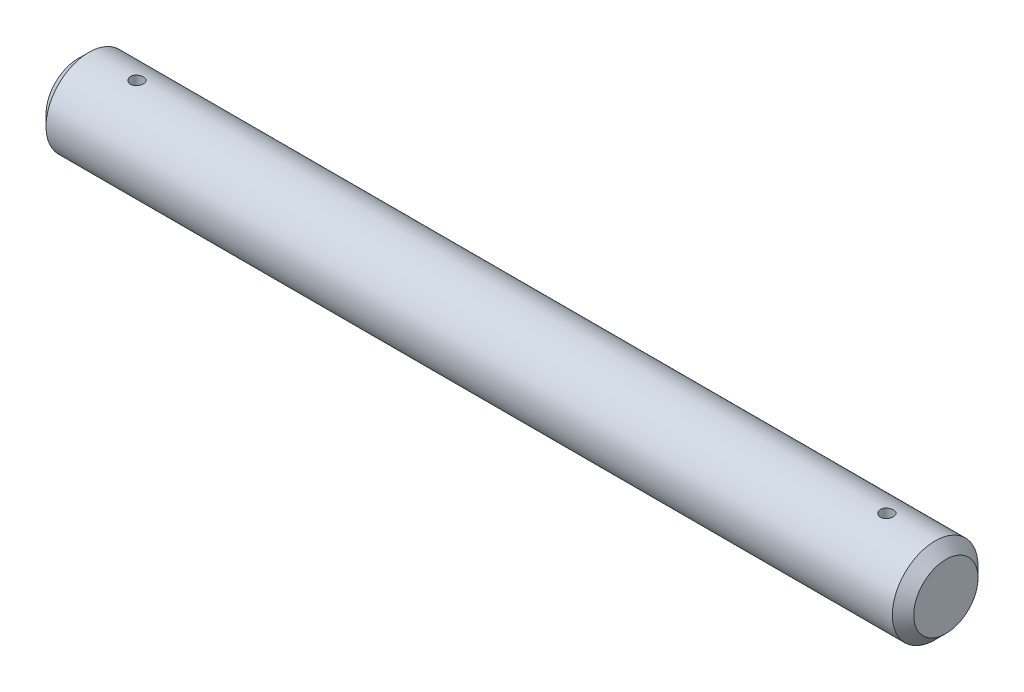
ISO-10303-21;
HEADER;
FILE_DESCRIPTION(('STEP AP214'),'2;1');
FILE_NAME('part.step','',(''),(''),'','','');
FILE_SCHEMA(('AUTOMOTIVE_DESIGN { 1 0 10303 214 1 1 1 1 }'));
ENDSEC;
DATA;
#1=APPLICATION_CONTEXT('core data for automotive mechanical design processes');
#2=APPLICATION_PROTOCOL_DEFINITION('international standard','automotive_design',2000,#1);
#3=PRODUCT_CONTEXT('',#1,'mechanical');
#4=PRODUCT('Part','Part','',(#3));
#5=PRODUCT_RELATED_PRODUCT_CATEGORY('part','',(#4));
#6=PRODUCT_DEFINITION_FORMATION('','',#4);
#7=PRODUCT_DEFINITION_CONTEXT('part definition',#1,'design');
#8=PRODUCT_DEFINITION('design','',#6,#7);
#9=PRODUCT_DEFINITION_SHAPE('','',#8);
#10=(LENGTH_UNIT() NAMED_UNIT(*) SI_UNIT(.MILLI.,.METRE.));
#11=(NAMED_UNIT(*) PLANE_ANGLE_UNIT() SI_UNIT($,.RADIAN.));
#12=(NAMED_UNIT(*) SI_UNIT($,.STERADIAN.) SOLID_ANGLE_UNIT());
#13=UNCERTAINTY_MEASURE_WITH_UNIT(LENGTH_MEASURE(1.E-05),#10,'distance_accuracy_value','');
#14=(GEOMETRIC_REPRESENTATION_CONTEXT(3) GLOBAL_UNCERTAINTY_ASSIGNED_CONTEXT((#13)) GLOBAL_UNIT_ASSIGNED_CONTEXT((#10,
#11,#12)) REPRESENTATION_CONTEXT('',''));
#15=CARTESIAN_POINT('',(0.,0.,0.));
#16=DIRECTION('',(0.,0.,1.));
#17=DIRECTION('',(1.,0.,0.));
#18=AXIS2_PLACEMENT_3D('',#15,#16,#17);
#19=CARTESIAN_POINT('',(40.5,0.,0.));
#20=DIRECTION('',(-1.,0.,0.));
#21=DIRECTION('',(0.,0.,1.));
#22=AXIS2_PLACEMENT_3D('',#19,#20,#21);
#23=CYLINDRICAL_SURFACE('',#22,4.);
#24=CARTESIAN_POINT('',(35.,-3.95474398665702,0.599999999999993));
#25=CARTESIAN_POINT('',(35.033498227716,-3.95474454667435,0.599998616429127));
#26=CARTESIAN_POINT('',(35.0670159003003,-3.9551742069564,0.597185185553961));
#27=CARTESIAN_POINT('',(35.1331141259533,-3.95684525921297,0.586008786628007));
#28=CARTESIAN_POINT('',(35.165693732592,-3.95808744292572,0.577640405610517));
#29=CARTESIAN_POINT('',(35.2289495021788,-3.96123975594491,0.555610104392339));
#30=CARTESIAN_POINT('',(35.2596271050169,-3.96314937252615,0.541952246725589));
#31=CARTESIAN_POINT('',(35.3182508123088,-3.96742077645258,0.509740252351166));
#32=CARTESIAN_POINT('',(35.3461972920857,-3.96978250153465,0.491186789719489));
#33=CARTESIAN_POINT('',(35.3987935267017,-3.97471315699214,0.449551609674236));
#34=CARTESIAN_POINT('',(35.4234182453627,-3.97728344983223,0.426438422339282));
#35=CARTESIAN_POINT('',(35.4684549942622,-3.98232947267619,0.376407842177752));
#36=CARTESIAN_POINT('',(35.4888667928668,-3.98480519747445,0.349490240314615));
#37=CARTESIAN_POINT('',(35.5249906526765,-3.98939738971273,0.292454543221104));
#38=CARTESIAN_POINT('',(35.540679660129,-3.99151207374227,0.262321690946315));
#39=CARTESIAN_POINT('',(35.5667646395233,-3.99512882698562,0.1998115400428));
#40=CARTESIAN_POINT('',(35.5771608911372,-3.99663092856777,0.16743436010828));
#41=CARTESIAN_POINT('',(35.5922893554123,-3.99884365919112,0.101612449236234));
#42=CARTESIAN_POINT('',(35.5970634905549,-3.99956014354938,0.0681775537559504));
#43=CARTESIAN_POINT('',(35.60094237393,-4.00014097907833,0.000974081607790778));
#44=CARTESIAN_POINT('',(35.6000474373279,-4.00000537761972,-0.0327944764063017));
#45=CARTESIAN_POINT('',(35.592646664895,-3.99890199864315,-0.0994206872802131));
#46=CARTESIAN_POINT('',(35.5861859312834,-3.99794091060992,-0.132283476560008));
#47=CARTESIAN_POINT('',(35.567907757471,-3.9953020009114,-0.196453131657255));
#48=CARTESIAN_POINT('',(35.5560901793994,-3.99362416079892,-0.227759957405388));
#49=CARTESIAN_POINT('',(35.5273876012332,-3.98972877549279,-0.288065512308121));
#50=CARTESIAN_POINT('',(35.5104836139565,-3.98750921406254,-0.317055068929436));
#51=CARTESIAN_POINT('',(35.472101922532,-3.9827777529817,-0.37180316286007));
#52=CARTESIAN_POINT('',(35.4506239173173,-3.98026583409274,-0.39756148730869));
#53=CARTESIAN_POINT('',(35.4034526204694,-3.97520063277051,-0.445381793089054));
#54=CARTESIAN_POINT('',(35.377719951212,-3.97264718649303,-0.467404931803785));
#55=CARTESIAN_POINT('',(35.3229035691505,-3.96781081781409,-0.506826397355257));
#56=CARTESIAN_POINT('',(35.293819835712,-3.96552789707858,-0.524224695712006));
#57=CARTESIAN_POINT('',(35.2330864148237,-3.96149110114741,-0.553907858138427));
#58=CARTESIAN_POINT('',(35.201434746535,-3.95973763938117,-0.566188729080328));
#59=CARTESIAN_POINT('',(35.136485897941,-3.95696561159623,-0.585249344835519));
#60=CARTESIAN_POINT('',(35.1031888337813,-3.95594699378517,-0.592029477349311));
#61=CARTESIAN_POINT('',(35.036239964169,-3.95476980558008,-0.599842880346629));
#62=CARTESIAN_POINT('',(35.0025947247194,-3.9546029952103,-0.60093121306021));
#63=CARTESIAN_POINT('',(34.9356023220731,-3.95512643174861,-0.597476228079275));
#64=CARTESIAN_POINT('',(34.9022551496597,-3.95581665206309,-0.592933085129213));
#65=CARTESIAN_POINT('',(34.8369760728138,-3.95796880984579,-0.578390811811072));
#66=CARTESIAN_POINT('',(34.8050379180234,-3.95942686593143,-0.568419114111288));
#67=CARTESIAN_POINT('',(34.7432863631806,-3.96294720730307,-0.543331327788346));
#68=CARTESIAN_POINT('',(34.7134730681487,-3.9650095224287,-0.528214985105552));
#69=CARTESIAN_POINT('',(34.656570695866,-3.96952542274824,-0.493134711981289));
#70=CARTESIAN_POINT('',(34.6295038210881,-3.97198183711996,-0.473135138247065));
#71=CARTESIAN_POINT('',(34.5790908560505,-3.97700063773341,-0.428905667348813));
#72=CARTESIAN_POINT('',(34.5557449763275,-3.97956302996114,-0.404675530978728));
#73=CARTESIAN_POINT('',(34.5132389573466,-3.98453082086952,-0.352430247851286));
#74=CARTESIAN_POINT('',(34.494115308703,-3.98693473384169,-0.324385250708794));
#75=CARTESIAN_POINT('',(34.460850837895,-3.99129162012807,-0.26544883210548));
#76=CARTESIAN_POINT('',(34.446709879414,-3.99324460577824,-0.23455748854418));
#77=CARTESIAN_POINT('',(34.4238705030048,-3.99647307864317,-0.170919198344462));
#78=CARTESIAN_POINT('',(34.4151521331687,-3.99775104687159,-0.138179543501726));
#79=CARTESIAN_POINT('',(34.403340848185,-3.99949590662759,-0.0716803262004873));
#80=CARTESIAN_POINT('',(34.4002475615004,-3.9999628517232,-0.0379208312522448));
#81=CARTESIAN_POINT('',(34.3997833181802,-4.00003251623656,0.0293058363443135));
#82=CARTESIAN_POINT('',(34.4023565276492,-3.99964366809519,0.0627726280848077));
#83=CARTESIAN_POINT('',(34.4130325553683,-3.99806244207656,0.12879191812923));
#84=CARTESIAN_POINT('',(34.4211353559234,-3.99687006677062,0.161344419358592));
#85=CARTESIAN_POINT('',(34.4426207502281,-3.99381514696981,0.224595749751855));
#86=CARTESIAN_POINT('',(34.4559994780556,-3.99195309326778,0.255295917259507));
#87=CARTESIAN_POINT('',(34.4876509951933,-3.98776333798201,0.314024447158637));
#88=CARTESIAN_POINT('',(34.5059239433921,-3.98543562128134,0.342052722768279));
#89=CARTESIAN_POINT('',(34.5470470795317,-3.9805460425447,0.394925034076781));
#90=CARTESIAN_POINT('',(34.5699384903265,-3.97798219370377,0.419736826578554));
#91=CARTESIAN_POINT('',(34.6195620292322,-3.972924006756,0.46518723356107));
#92=CARTESIAN_POINT('',(34.6462950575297,-3.97042968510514,0.485824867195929));
#93=CARTESIAN_POINT('',(34.703019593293,-3.96577793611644,0.522445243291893));
#94=CARTESIAN_POINT('',(34.7330285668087,-3.96362248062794,0.538401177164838));
#95=CARTESIAN_POINT('',(34.7953187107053,-3.9599156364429,0.565022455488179));
#96=CARTESIAN_POINT('',(34.8275974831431,-3.95836362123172,0.575693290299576));
#97=CARTESIAN_POINT('',(34.8833509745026,-3.9563979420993,0.589019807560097));
#98=CARTESIAN_POINT('',(34.9064813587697,-3.95578099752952,0.593131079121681));
#99=CARTESIAN_POINT('',(34.9530713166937,-3.95495382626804,0.598621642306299));
#100=CARTESIAN_POINT('',(34.9765308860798,-3.95474359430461,0.600000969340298));
#101=CARTESIAN_POINT('',(35.,-3.95474398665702,0.599999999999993));
#102=B_SPLINE_CURVE_WITH_KNOTS('',3,(#24,#25,#26,#27,#28,#29,#30,#31,#32,#33,#34,#35,#36,#37,
#38,#39,#40,#41,#42,#43,#44,#45,#46,#47,#48,#49,#50,#51,#52,#53,#54,#55,#56,#57,#58,#59,#60,#61,
#62,#63,#64,#65,#66,#67,#68,#69,#70,#71,#72,#73,#74,#75,#76,#77,#78,#79,#80,#81,#82,#83,#84,#85,
#86,#87,#88,#89,#90,#91,#92,#93,#94,#95,#96,#97,#98,#99,#100,#101),.UNSPECIFIED.,.T.,.F.,(4,2,2,
2,2,2,2,2,2,2,2,2,2,2,2,2,2,2,2,2,2,2,2,2,2,2,2,2,2,2,2,2,2,2,2,2,2,2,4),(0.,0.100408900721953,
0.20091578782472,0.301345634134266,0.401761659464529,0.502896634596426,0.604037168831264,
0.705663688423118,0.807284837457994,0.908143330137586,1.0089962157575,1.10903945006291,
1.2090852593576,1.30950926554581,1.40993988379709,1.51135817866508,1.61277709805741,
1.71427500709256,1.81576576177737,1.91627285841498,2.01677683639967,2.11677757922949,
2.21678326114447,2.3175419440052,2.4183063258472,2.51991015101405,2.62151119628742,
2.72273616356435,2.82395444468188,2.92417985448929,3.02440494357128,3.12455672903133,
3.22471176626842,3.32580380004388,3.42691956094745,3.52860351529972,3.63018161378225,
3.70052976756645,3.77087700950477),.UNSPECIFIED.);
#103=CARTESIAN_POINT('',(35.,-3.95474398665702,0.599999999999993));
#104=VERTEX_POINT('',#103);
#105=EDGE_CURVE('E37',#104,#104,#102,.T.);
#106=ORIENTED_EDGE('',*,*,#105,.T.);
#107=EDGE_LOOP('',(#106));
#108=FACE_BOUND('',#107,.T.);
#109=CARTESIAN_POINT('',(35.,3.95474398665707,0.599999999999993));
#110=CARTESIAN_POINT('',(34.966501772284,3.95474454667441,0.599998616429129));
#111=CARTESIAN_POINT('',(34.9329840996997,3.95517420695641,0.597185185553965));
#112=CARTESIAN_POINT('',(34.8668858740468,3.95684525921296,0.58600878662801));
#113=CARTESIAN_POINT('',(34.834306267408,3.95808744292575,0.577640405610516));
#114=CARTESIAN_POINT('',(34.7710504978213,3.96123975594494,0.55561010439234));
#115=CARTESIAN_POINT('',(34.7403728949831,3.96314937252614,0.541952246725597));
#116=CARTESIAN_POINT('',(34.6817491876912,3.96742077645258,0.509740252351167));
#117=CARTESIAN_POINT('',(34.6538027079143,3.9697825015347,0.491186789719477));
#118=CARTESIAN_POINT('',(34.6012064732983,3.97471315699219,0.449551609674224));
#119=CARTESIAN_POINT('',(34.5765817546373,3.97728344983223,0.426438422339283));
#120=CARTESIAN_POINT('',(34.5315450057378,3.98232947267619,0.376407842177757));
#121=CARTESIAN_POINT('',(34.5111332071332,3.9848051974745,0.349490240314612));
#122=CARTESIAN_POINT('',(34.4750093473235,3.98939738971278,0.292454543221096));
#123=CARTESIAN_POINT('',(34.459320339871,3.99151207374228,0.26232169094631));
#124=CARTESIAN_POINT('',(34.4332353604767,3.99512882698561,0.199811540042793));
#125=CARTESIAN_POINT('',(34.4228391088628,3.9966309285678,0.16743436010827));
#126=CARTESIAN_POINT('',(34.4077106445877,3.99884365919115,0.101612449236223));
#127=CARTESIAN_POINT('',(34.4029365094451,3.99956014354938,0.0681775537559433));
#128=CARTESIAN_POINT('',(34.39905762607,4.00014097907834,0.000974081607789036));
#129=CARTESIAN_POINT('',(34.3999525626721,4.00000537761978,-0.0327944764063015));
#130=CARTESIAN_POINT('',(34.407353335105,3.99890199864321,-0.0994206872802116));
#131=CARTESIAN_POINT('',(34.4138140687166,3.99794091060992,-0.132283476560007));
#132=CARTESIAN_POINT('',(34.432092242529,3.9953020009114,-0.196453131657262));
#133=CARTESIAN_POINT('',(34.4439098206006,3.99362416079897,-0.227759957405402));
#134=CARTESIAN_POINT('',(34.4726123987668,3.98972877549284,-0.288065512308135));
#135=CARTESIAN_POINT('',(34.4895163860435,3.98750921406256,-0.317055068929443));
#136=CARTESIAN_POINT('',(34.527898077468,3.98277775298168,-0.371803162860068));
#137=CARTESIAN_POINT('',(34.5493760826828,3.98026583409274,-0.397561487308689));
#138=CARTESIAN_POINT('',(34.5965473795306,3.97520063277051,-0.445381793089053));
#139=CARTESIAN_POINT('',(34.622280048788,3.97264718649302,-0.467404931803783));
#140=CARTESIAN_POINT('',(34.6770964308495,3.9678108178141,-0.506826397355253));
#141=CARTESIAN_POINT('',(34.706180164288,3.96552789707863,-0.524224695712));
#142=CARTESIAN_POINT('',(34.7669135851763,3.96149110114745,-0.553907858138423));
#143=CARTESIAN_POINT('',(34.798565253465,3.95973763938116,-0.566188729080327));
#144=CARTESIAN_POINT('',(34.863514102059,3.95696561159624,-0.585249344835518));
#145=CARTESIAN_POINT('',(34.8968111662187,3.95594699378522,-0.59202947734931));
#146=CARTESIAN_POINT('',(34.963760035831,3.95476980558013,-0.599842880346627));
#147=CARTESIAN_POINT('',(34.9974052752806,3.9546029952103,-0.600931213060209));
#148=CARTESIAN_POINT('',(35.0643976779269,3.95512643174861,-0.597476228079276));
#149=CARTESIAN_POINT('',(35.0977448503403,3.95581665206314,-0.592933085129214));
#150=CARTESIAN_POINT('',(35.1630239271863,3.95796880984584,-0.57839081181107));
#151=CARTESIAN_POINT('',(35.1949620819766,3.95942686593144,-0.568419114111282));
#152=CARTESIAN_POINT('',(35.2567136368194,3.96294720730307,-0.543331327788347));
#153=CARTESIAN_POINT('',(35.2865269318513,3.96500952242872,-0.528214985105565));
#154=CARTESIAN_POINT('',(35.343429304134,3.96952542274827,-0.493134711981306));
#155=CARTESIAN_POINT('',(35.3704961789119,3.97198183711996,-0.47313513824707));
#156=CARTESIAN_POINT('',(35.4209091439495,3.97700063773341,-0.428905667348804));
#157=CARTESIAN_POINT('',(35.4442550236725,3.97956302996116,-0.404675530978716));
#158=CARTESIAN_POINT('',(35.4867610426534,3.98453082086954,-0.352430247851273));
#159=CARTESIAN_POINT('',(35.505884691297,3.98693473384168,-0.324385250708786));
#160=CARTESIAN_POINT('',(35.5391491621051,3.99129162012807,-0.265448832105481));
#161=CARTESIAN_POINT('',(35.553290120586,3.99324460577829,-0.234557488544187));
#162=CARTESIAN_POINT('',(35.5761294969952,3.99647307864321,-0.17091919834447));
#163=CARTESIAN_POINT('',(35.5848478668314,3.9977510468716,-0.138179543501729));
#164=CARTESIAN_POINT('',(35.596659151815,3.99949590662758,-0.0716803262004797));
#165=CARTESIAN_POINT('',(35.5997524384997,3.99996285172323,-0.0379208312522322));
#166=CARTESIAN_POINT('',(35.6002166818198,4.0000325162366,0.0293058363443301));
#167=CARTESIAN_POINT('',(35.5976434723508,3.99964366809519,0.0627726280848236));
#168=CARTESIAN_POINT('',(35.5869674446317,3.99806244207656,0.128791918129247));
#169=CARTESIAN_POINT('',(35.5788646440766,3.99687006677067,0.161344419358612));
#170=CARTESIAN_POINT('',(35.5573792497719,3.99381514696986,0.224595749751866));
#171=CARTESIAN_POINT('',(35.5440005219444,3.99195309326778,0.255295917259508));
#172=CARTESIAN_POINT('',(35.5123490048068,3.987763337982,0.314024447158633));
#173=CARTESIAN_POINT('',(35.4940760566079,3.98543562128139,0.342052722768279));
#174=CARTESIAN_POINT('',(35.4529529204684,3.98054604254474,0.394925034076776));
#175=CARTESIAN_POINT('',(35.4300615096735,3.97798219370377,0.419736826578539));
#176=CARTESIAN_POINT('',(35.3804379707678,3.972924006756,0.465187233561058));
#177=CARTESIAN_POINT('',(35.3537049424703,3.9704296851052,0.485824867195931));
#178=CARTESIAN_POINT('',(35.296980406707,3.9657779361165,0.522445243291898));
#179=CARTESIAN_POINT('',(35.2669714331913,3.96362248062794,0.538401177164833));
#180=CARTESIAN_POINT('',(35.2046812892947,3.95991563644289,0.565022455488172));
#181=CARTESIAN_POINT('',(35.1724025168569,3.95836362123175,0.57569329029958));
#182=CARTESIAN_POINT('',(35.1166490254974,3.95639794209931,0.5890198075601));
#183=CARTESIAN_POINT('',(35.0935186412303,3.95578099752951,0.59313107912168));
#184=CARTESIAN_POINT('',(35.0469286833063,3.95495382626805,0.598621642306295));
#185=CARTESIAN_POINT('',(35.0234691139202,3.95474359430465,0.600000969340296));
#186=CARTESIAN_POINT('',(35.,3.95474398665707,0.599999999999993));
#187=B_SPLINE_CURVE_WITH_KNOTS('',3,(#109,#110,#111,#112,#113,#114,#115,#116,#117,#118,#119,
#120,#121,#122,#123,#124,#125,#126,#127,#128,#129,#130,#131,#132,#133,#134,#135,#136,#137,#138,
#139,#140,#141,#142,#143,#144,#145,#146,#147,#148,#149,#150,#151,#152,#153,#154,#155,#156,#157,
#158,#159,#160,#161,#162,#163,#164,#165,#166,#167,#168,#169,#170,#171,#172,#173,#174,#175,#176,
#177,#178,#179,#180,#181,#182,#183,#184,#185,#186),.UNSPECIFIED.,.T.,.F.,(4,2,2,2,2,2,2,2,2,2,2,
2,2,2,2,2,2,2,2,2,2,2,2,2,2,2,2,2,2,2,2,2,2,2,2,2,2,2,4),(0.,0.100408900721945,
0.200915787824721,0.301345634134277,0.40176165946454,0.502896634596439,0.604037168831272,
0.70566368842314,0.807284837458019,0.908143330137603,1.00899621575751,1.10903945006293,
1.20908525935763,1.30950926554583,1.4099398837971,1.51135817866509,1.61277709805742,
1.71427500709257,1.81576576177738,1.91627285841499,2.01677683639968,2.11677757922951,
2.21678326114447,2.31754194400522,2.41830632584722,2.51991015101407,2.62151119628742,
2.72273616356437,2.82395444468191,2.92417985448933,3.02440494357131,3.12455672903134,
3.22471176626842,3.32580380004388,3.42691956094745,3.52860351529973,3.63018161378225,
3.70052976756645,3.77087700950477),.UNSPECIFIED.);
#188=CARTESIAN_POINT('',(35.,3.95474398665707,0.599999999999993));
#189=VERTEX_POINT('',#188);
#190=EDGE_CURVE('E93',#189,#189,#187,.T.);
#191=ORIENTED_EDGE('',*,*,#190,.T.);
#192=EDGE_LOOP('',(#191));
#193=FACE_BOUND('',#192,.T.);
#194=CARTESIAN_POINT('',(-35.,-3.95474398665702,0.599999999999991));
#195=CARTESIAN_POINT('',(-34.966501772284,-3.95474454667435,0.599998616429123));
#196=CARTESIAN_POINT('',(-34.9329840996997,-3.95517420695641,0.597185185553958));
#197=CARTESIAN_POINT('',(-34.8668858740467,-3.95684525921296,0.586008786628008));
#198=CARTESIAN_POINT('',(-34.834306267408,-3.95808744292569,0.577640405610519));
#199=CARTESIAN_POINT('',(-34.7710504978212,-3.96123975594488,0.55561010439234));
#200=CARTESIAN_POINT('',(-34.7403728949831,-3.96314937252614,0.541952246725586));
#201=CARTESIAN_POINT('',(-34.6817491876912,-3.96742077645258,0.509740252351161));
#202=CARTESIAN_POINT('',(-34.6538027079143,-3.96978250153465,0.491186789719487));
#203=CARTESIAN_POINT('',(-34.6012064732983,-3.97471315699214,0.449551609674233));
#204=CARTESIAN_POINT('',(-34.5765817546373,-3.97728344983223,0.426438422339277));
#205=CARTESIAN_POINT('',(-34.5315450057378,-3.98232947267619,0.376407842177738));
#206=CARTESIAN_POINT('',(-34.5111332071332,-3.98480519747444,0.349490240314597));
#207=CARTESIAN_POINT('',(-34.4750093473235,-3.98939738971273,0.292454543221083));
#208=CARTESIAN_POINT('',(-34.459320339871,-3.99151207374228,0.262321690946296));
#209=CARTESIAN_POINT('',(-34.4332353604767,-3.99512882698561,0.199811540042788));
#210=CARTESIAN_POINT('',(-34.4228391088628,-3.99663092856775,0.167434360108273));
#211=CARTESIAN_POINT('',(-34.4077106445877,-3.9988436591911,0.101612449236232));
#212=CARTESIAN_POINT('',(-34.4029365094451,-3.99956014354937,0.0681775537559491));
#213=CARTESIAN_POINT('',(-34.39905762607,-4.00014097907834,0.000974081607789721));
#214=CARTESIAN_POINT('',(-34.3999525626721,-4.00000537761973,-0.0327944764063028));
#215=CARTESIAN_POINT('',(-34.407353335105,-3.99890199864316,-0.0994206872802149));
#216=CARTESIAN_POINT('',(-34.4138140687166,-3.99794091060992,-0.13228347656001));
#217=CARTESIAN_POINT('',(-34.432092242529,-3.9953020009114,-0.196453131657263));
#218=CARTESIAN_POINT('',(-34.4439098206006,-3.99362416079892,-0.2277599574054));
#219=CARTESIAN_POINT('',(-34.4726123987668,-3.98972877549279,-0.288065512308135));
#220=CARTESIAN_POINT('',(-34.4895163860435,-3.98750921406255,-0.317055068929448));
#221=CARTESIAN_POINT('',(-34.527898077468,-3.98277775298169,-0.371803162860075));
#222=CARTESIAN_POINT('',(-34.5493760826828,-3.98026583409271,-0.397561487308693));
#223=CARTESIAN_POINT('',(-34.5965473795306,-3.97520063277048,-0.445381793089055));
#224=CARTESIAN_POINT('',(-34.6222800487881,-3.97264718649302,-0.467404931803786));
#225=CARTESIAN_POINT('',(-34.6770964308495,-3.96781081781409,-0.506826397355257));
#226=CARTESIAN_POINT('',(-34.706180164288,-3.96552789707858,-0.524224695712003));
#227=CARTESIAN_POINT('',(-34.7669135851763,-3.9614911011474,-0.553907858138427));
#228=CARTESIAN_POINT('',(-34.798565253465,-3.95973763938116,-0.566188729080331));
#229=CARTESIAN_POINT('',(-34.863514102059,-3.95696561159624,-0.585249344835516));
#230=CARTESIAN_POINT('',(-34.8968111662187,-3.95594699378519,-0.592029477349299));
#231=CARTESIAN_POINT('',(-34.963760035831,-3.9547698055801,-0.599842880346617));
#232=CARTESIAN_POINT('',(-34.9974052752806,-3.9546029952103,-0.600931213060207));
#233=CARTESIAN_POINT('',(-35.064397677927,-3.95512643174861,-0.597476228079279));
#234=CARTESIAN_POINT('',(-35.0977448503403,-3.95581665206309,-0.592933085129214));
#235=CARTESIAN_POINT('',(-35.1630239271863,-3.95796880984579,-0.578390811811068));
#236=CARTESIAN_POINT('',(-35.1949620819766,-3.95942686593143,-0.568419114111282));
#237=CARTESIAN_POINT('',(-35.2567136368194,-3.96294720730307,-0.543331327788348));
#238=CARTESIAN_POINT('',(-35.2865269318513,-3.9650095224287,-0.528214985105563));
#239=CARTESIAN_POINT('',(-35.343429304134,-3.96952542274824,-0.493134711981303));
#240=CARTESIAN_POINT('',(-35.3704961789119,-3.97198183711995,-0.473135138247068));
#241=CARTESIAN_POINT('',(-35.4209091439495,-3.97700063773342,-0.42890566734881));
#242=CARTESIAN_POINT('',(-35.4442550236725,-3.97956302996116,-0.404675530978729));
#243=CARTESIAN_POINT('',(-35.4867610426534,-3.98453082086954,-0.352430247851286));
#244=CARTESIAN_POINT('',(-35.505884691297,-3.98693473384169,-0.32438525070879));
#245=CARTESIAN_POINT('',(-35.5391491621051,-3.99129162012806,-0.265448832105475));
#246=CARTESIAN_POINT('',(-35.553290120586,-3.99324460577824,-0.234557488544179));
#247=CARTESIAN_POINT('',(-35.5761294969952,-3.99647307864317,-0.17091919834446));
#248=CARTESIAN_POINT('',(-35.5848478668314,-3.99775104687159,-0.138179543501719));
#249=CARTESIAN_POINT('',(-35.596659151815,-3.99949590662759,-0.0716803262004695));
#250=CARTESIAN_POINT('',(-35.5997524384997,-3.9999628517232,-0.0379208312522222));
#251=CARTESIAN_POINT('',(-35.6002166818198,-4.00003251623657,0.0293058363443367));
#252=CARTESIAN_POINT('',(-35.5976434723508,-3.99964366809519,0.0627726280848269));
#253=CARTESIAN_POINT('',(-35.5869674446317,-3.99806244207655,0.12879191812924));
#254=CARTESIAN_POINT('',(-35.5788646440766,-3.99687006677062,0.161344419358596));
#255=CARTESIAN_POINT('',(-35.5573792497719,-3.99381514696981,0.224595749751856));
#256=CARTESIAN_POINT('',(-35.5440005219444,-3.99195309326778,0.25529591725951));
#257=CARTESIAN_POINT('',(-35.5123490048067,-3.987763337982,0.314024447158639));
#258=CARTESIAN_POINT('',(-35.4940760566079,-3.98543562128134,0.342052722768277));
#259=CARTESIAN_POINT('',(-35.4529529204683,-3.9805460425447,0.394925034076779));
#260=CARTESIAN_POINT('',(-35.4300615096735,-3.97798219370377,0.419736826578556));
#261=CARTESIAN_POINT('',(-35.3804379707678,-3.972924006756,0.465187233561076));
#262=CARTESIAN_POINT('',(-35.3537049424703,-3.97042968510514,0.485824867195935));
#263=CARTESIAN_POINT('',(-35.296980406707,-3.96577793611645,0.522445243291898));
#264=CARTESIAN_POINT('',(-35.2669714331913,-3.96362248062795,0.538401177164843));
#265=CARTESIAN_POINT('',(-35.2046812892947,-3.95991563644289,0.56502245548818));
#266=CARTESIAN_POINT('',(-35.1724025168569,-3.95836362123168,0.575693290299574));
#267=CARTESIAN_POINT('',(-35.1166490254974,-3.95639794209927,0.589019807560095));
#268=CARTESIAN_POINT('',(-35.0935186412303,-3.95578099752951,0.593131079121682));
#269=CARTESIAN_POINT('',(-35.0469286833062,-3.95495382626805,0.5986216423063));
#270=CARTESIAN_POINT('',(-35.0234691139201,-3.95474359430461,0.600000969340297));
#271=CARTESIAN_POINT('',(-35.,-3.95474398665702,0.599999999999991));
#272=B_SPLINE_CURVE_WITH_KNOTS('',3,(#194,#195,#196,#197,#198,#199,#200,#201,#202,#203,#204,
#205,#206,#207,#208,#209,#210,#211,#212,#213,#214,#215,#216,#217,#218,#219,#220,#221,#222,#223,
#224,#225,#226,#227,#228,#229,#230,#231,#232,#233,#234,#235,#236,#237,#238,#239,#240,#241,#242,
#243,#244,#245,#246,#247,#248,#249,#250,#251,#252,#253,#254,#255,#256,#257,#258,#259,#260,#261,
#262,#263,#264,#265,#266,#267,#268,#269,#270,#271),.UNSPECIFIED.,.T.,.F.,(4,2,2,2,2,2,2,2,2,2,2,
2,2,2,2,2,2,2,2,2,2,2,2,2,2,2,2,2,2,2,2,2,2,2,2,2,2,2,4),(0.,0.100408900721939,
0.200915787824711,0.301345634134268,0.401761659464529,0.502896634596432,0.604037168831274,
0.705663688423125,0.807284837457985,0.908143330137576,1.00899621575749,1.10903945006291,
1.20908525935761,1.30950926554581,1.40993988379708,1.51135817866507,1.6127770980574,
1.71427500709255,1.81576576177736,1.91627285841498,2.01677683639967,2.11677757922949,
2.21678326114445,2.31754194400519,2.41830632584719,2.51991015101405,2.62151119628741,
2.72273616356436,2.8239544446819,2.9241798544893,3.02440494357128,3.12455672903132,
3.22471176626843,3.32580380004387,3.42691956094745,3.52860351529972,3.63018161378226,
3.70052976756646,3.77087700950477),.UNSPECIFIED.);
#273=CARTESIAN_POINT('',(-35.,-3.95474398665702,0.599999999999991));
#274=VERTEX_POINT('',#273);
#275=EDGE_CURVE('E60',#274,#274,#272,.T.);
#276=ORIENTED_EDGE('',*,*,#275,.T.);
#277=EDGE_LOOP('',(#276));
#278=FACE_BOUND('',#277,.T.);
#279=CARTESIAN_POINT('',(-35.,3.95474398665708,0.599999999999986));
#280=CARTESIAN_POINT('',(-35.033498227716,3.95474454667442,0.59999861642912));
#281=CARTESIAN_POINT('',(-35.0670159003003,3.95517420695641,0.59718518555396));
#282=CARTESIAN_POINT('',(-35.1331141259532,3.95684525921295,0.586008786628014));
#283=CARTESIAN_POINT('',(-35.165693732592,3.95808744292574,0.577640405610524));
#284=CARTESIAN_POINT('',(-35.2289495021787,3.96123975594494,0.555610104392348));
#285=CARTESIAN_POINT('',(-35.2596271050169,3.96314937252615,0.5419522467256));
#286=CARTESIAN_POINT('',(-35.3182508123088,3.96742077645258,0.509740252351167));
#287=CARTESIAN_POINT('',(-35.3461972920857,3.96978250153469,0.491186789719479));
#288=CARTESIAN_POINT('',(-35.3987935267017,3.97471315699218,0.449551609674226));
#289=CARTESIAN_POINT('',(-35.4234182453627,3.97728344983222,0.426438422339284));
#290=CARTESIAN_POINT('',(-35.4684549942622,3.98232947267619,0.376407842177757));
#291=CARTESIAN_POINT('',(-35.4888667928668,3.9848051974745,0.349490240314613));
#292=CARTESIAN_POINT('',(-35.5249906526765,3.98939738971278,0.292454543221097));
#293=CARTESIAN_POINT('',(-35.540679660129,3.99151207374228,0.26232169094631));
#294=CARTESIAN_POINT('',(-35.5667646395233,3.99512882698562,0.19981154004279));
#295=CARTESIAN_POINT('',(-35.5771608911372,3.99663092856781,0.167434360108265));
#296=CARTESIAN_POINT('',(-35.5922893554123,3.99884365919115,0.101612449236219));
#297=CARTESIAN_POINT('',(-35.5970634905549,3.99956014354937,0.0681775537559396));
#298=CARTESIAN_POINT('',(-35.60094237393,4.00014097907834,0.000974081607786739));
#299=CARTESIAN_POINT('',(-35.6000474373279,4.00000537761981,-0.0327944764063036));
#300=CARTESIAN_POINT('',(-35.592646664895,3.99890199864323,-0.099420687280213));
#301=CARTESIAN_POINT('',(-35.5861859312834,3.99794091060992,-0.132283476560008));
#302=CARTESIAN_POINT('',(-35.567907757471,3.9953020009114,-0.19645313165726));
#303=CARTESIAN_POINT('',(-35.5560901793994,3.99362416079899,-0.227759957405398));
#304=CARTESIAN_POINT('',(-35.5273876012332,3.98972877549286,-0.288065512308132));
#305=CARTESIAN_POINT('',(-35.5104836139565,3.98750921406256,-0.317055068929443));
#306=CARTESIAN_POINT('',(-35.472101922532,3.98277775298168,-0.371803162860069));
#307=CARTESIAN_POINT('',(-35.4506239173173,3.98026583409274,-0.397561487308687));
#308=CARTESIAN_POINT('',(-35.4034526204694,3.97520063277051,-0.445381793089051));
#309=CARTESIAN_POINT('',(-35.377719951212,3.97264718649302,-0.467404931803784));
#310=CARTESIAN_POINT('',(-35.3229035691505,3.9678108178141,-0.506826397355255));
#311=CARTESIAN_POINT('',(-35.293819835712,3.96552789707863,-0.524224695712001));
#312=CARTESIAN_POINT('',(-35.2330864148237,3.96149110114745,-0.553907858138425));
#313=CARTESIAN_POINT('',(-35.201434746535,3.95973763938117,-0.566188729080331));
#314=CARTESIAN_POINT('',(-35.136485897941,3.95696561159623,-0.585249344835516));
#315=CARTESIAN_POINT('',(-35.1031888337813,3.95594699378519,-0.5920294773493));
#316=CARTESIAN_POINT('',(-35.036239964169,3.9547698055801,-0.599842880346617));
#317=CARTESIAN_POINT('',(-35.0025947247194,3.95460299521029,-0.600931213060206));
#318=CARTESIAN_POINT('',(-34.9356023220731,3.95512643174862,-0.597476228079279));
#319=CARTESIAN_POINT('',(-34.9022551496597,3.95581665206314,-0.592933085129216));
#320=CARTESIAN_POINT('',(-34.8369760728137,3.95796880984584,-0.578390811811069));
#321=CARTESIAN_POINT('',(-34.8050379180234,3.95942686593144,-0.568419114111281));
#322=CARTESIAN_POINT('',(-34.7432863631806,3.96294720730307,-0.543331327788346));
#323=CARTESIAN_POINT('',(-34.7134730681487,3.96500952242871,-0.528214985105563));
#324=CARTESIAN_POINT('',(-34.656570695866,3.96952542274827,-0.493134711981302));
#325=CARTESIAN_POINT('',(-34.6295038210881,3.97198183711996,-0.473135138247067));
#326=CARTESIAN_POINT('',(-34.5790908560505,3.97700063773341,-0.42890566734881));
#327=CARTESIAN_POINT('',(-34.5557449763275,3.97956302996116,-0.40467553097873));
#328=CARTESIAN_POINT('',(-34.5132389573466,3.98453082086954,-0.352430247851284));
#329=CARTESIAN_POINT('',(-34.494115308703,3.98693473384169,-0.324385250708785));
#330=CARTESIAN_POINT('',(-34.460850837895,3.99129162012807,-0.265448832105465));
#331=CARTESIAN_POINT('',(-34.446709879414,3.99324460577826,-0.234557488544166));
#332=CARTESIAN_POINT('',(-34.4238705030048,3.99647307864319,-0.170919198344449));
#333=CARTESIAN_POINT('',(-34.4151521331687,3.99775104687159,-0.138179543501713));
#334=CARTESIAN_POINT('',(-34.403340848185,3.99949590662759,-0.0716803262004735));
#335=CARTESIAN_POINT('',(-34.4002475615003,3.99996285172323,-0.0379208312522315));
#336=CARTESIAN_POINT('',(-34.3997833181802,4.00003251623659,0.0293058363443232));
#337=CARTESIAN_POINT('',(-34.4023565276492,3.99964366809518,0.0627726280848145));
#338=CARTESIAN_POINT('',(-34.4130325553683,3.99806244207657,0.128791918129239));
#339=CARTESIAN_POINT('',(-34.4211353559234,3.9968700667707,0.161344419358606));
#340=CARTESIAN_POINT('',(-34.4426207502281,3.9938151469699,0.224595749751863));
#341=CARTESIAN_POINT('',(-34.4559994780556,3.9919530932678,0.255295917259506));
#342=CARTESIAN_POINT('',(-34.4876509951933,3.98776333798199,0.314024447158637));
#343=CARTESIAN_POINT('',(-34.5059239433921,3.98543562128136,0.34205272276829));
#344=CARTESIAN_POINT('',(-34.5470470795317,3.98054604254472,0.394925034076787));
#345=CARTESIAN_POINT('',(-34.5699384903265,3.97798219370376,0.419736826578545));
#346=CARTESIAN_POINT('',(-34.6195620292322,3.97292400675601,0.465187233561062));
#347=CARTESIAN_POINT('',(-34.6462950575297,3.9704296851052,0.485824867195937));
#348=CARTESIAN_POINT('',(-34.703019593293,3.9657779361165,0.522445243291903));
#349=CARTESIAN_POINT('',(-34.7330285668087,3.96362248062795,0.538401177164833));
#350=CARTESIAN_POINT('',(-34.7953187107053,3.95991563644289,0.565022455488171));
#351=CARTESIAN_POINT('',(-34.8275974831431,3.95836362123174,0.575693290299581));
#352=CARTESIAN_POINT('',(-34.8833509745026,3.95639794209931,0.589019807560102));
#353=CARTESIAN_POINT('',(-34.9064813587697,3.95578099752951,0.593131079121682));
#354=CARTESIAN_POINT('',(-34.9530713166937,3.95495382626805,0.598621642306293));
#355=CARTESIAN_POINT('',(-34.9765308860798,3.95474359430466,0.600000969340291));
#356=CARTESIAN_POINT('',(-35.,3.95474398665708,0.599999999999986));
#357=B_SPLINE_CURVE_WITH_KNOTS('',3,(#279,#280,#281,#282,#283,#284,#285,#286,#287,#288,#289,
#290,#291,#292,#293,#294,#295,#296,#297,#298,#299,#300,#301,#302,#303,#304,#305,#306,#307,#308,
#309,#310,#311,#312,#313,#314,#315,#316,#317,#318,#319,#320,#321,#322,#323,#324,#325,#326,#327,
#328,#329,#330,#331,#332,#333,#334,#335,#336,#337,#338,#339,#340,#341,#342,#343,#344,#345,#346,
#347,#348,#349,#350,#351,#352,#353,#354,#355,#356),.UNSPECIFIED.,.T.,.F.,(4,2,2,2,2,2,2,2,2,2,2,
2,2,2,2,2,2,2,2,2,2,2,2,2,2,2,2,2,2,2,2,2,2,2,2,2,2,2,4),(0.,0.100408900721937,
0.200915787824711,0.30134563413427,0.401761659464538,0.502896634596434,0.604037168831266,
0.705663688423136,0.807284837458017,0.9081433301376,1.00899621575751,1.10903945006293,
1.20908525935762,1.30950926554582,1.40993988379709,1.51135817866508,1.61277709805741,
1.71427500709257,1.81576576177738,1.916272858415,2.01677683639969,2.1167775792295,
2.21678326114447,2.31754194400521,2.41830632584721,2.51991015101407,2.62151119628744,
2.72273616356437,2.8239544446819,2.92417985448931,3.0244049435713,3.12455672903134,
3.22471176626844,3.32580380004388,3.42691956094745,3.52860351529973,3.63018161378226,
3.70052976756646,3.77087700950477),.UNSPECIFIED.);
#358=CARTESIAN_POINT('',(-35.,3.95474398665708,0.599999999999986));
#359=VERTEX_POINT('',#358);
#360=EDGE_CURVE('E54',#359,#359,#357,.T.);
#361=ORIENTED_EDGE('',*,*,#360,.T.);
#362=EDGE_LOOP('',(#361));
#363=FACE_BOUND('',#362,.T.);
#364=CARTESIAN_POINT('',(-39.5,0.,0.));
#365=DIRECTION('',(1.,0.,0.));
#366=DIRECTION('',(0.,0.,-1.));
#367=AXIS2_PLACEMENT_3D('',#364,#365,#366);
#368=CIRCLE('',#367,4.);
#369=CARTESIAN_POINT('',(-39.5,0.,-4.00000000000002));
#370=VERTEX_POINT('',#369);
#371=EDGE_CURVE('E50',#370,#370,#368,.T.);
#372=ORIENTED_EDGE('',*,*,#371,.T.);
#373=EDGE_LOOP('',(#372));
#374=FACE_BOUND('',#373,.T.);
#375=CARTESIAN_POINT('',(39.5,0.,0.));
#376=DIRECTION('',(1.,0.,0.));
#377=DIRECTION('',(0.,0.,-1.));
#378=AXIS2_PLACEMENT_3D('',#375,#376,#377);
#379=CIRCLE('',#378,4.);
#380=CARTESIAN_POINT('',(39.5,0.,-4.00000000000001));
#381=VERTEX_POINT('',#380);
#382=EDGE_CURVE('E104',#381,#381,#379,.F.);
#383=ORIENTED_EDGE('',*,*,#382,.T.);
#384=EDGE_LOOP('',(#383));
#385=FACE_BOUND('',#384,.T.);
#386=ADVANCED_FACE('F33',(#108,#193,#278,#363,#374,#385),#23,.T.);
#387=CARTESIAN_POINT('',(40.5,0.,0.));
#388=DIRECTION('',(1.,0.,0.));
#389=DIRECTION('',(0.,0.,-1.));
#390=AXIS2_PLACEMENT_3D('',#387,#388,#389);
#391=PLANE('',#390);
#392=CARTESIAN_POINT('',(40.5,0.,0.));
#393=DIRECTION('',(1.,0.,0.));
#394=DIRECTION('',(0.,0.,-1.));
#395=AXIS2_PLACEMENT_3D('',#392,#393,#394);
#396=CIRCLE('',#395,3.00000000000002);
#397=CARTESIAN_POINT('',(40.5,0.,-3.00000000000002));
#398=VERTEX_POINT('',#397);
#399=EDGE_CURVE('E10',#398,#398,#396,.T.);
#400=ORIENTED_EDGE('',*,*,#399,.T.);
#401=EDGE_LOOP('',(#400));
#402=FACE_BOUND('',#401,.T.);
#403=ADVANCED_FACE('F72',(#402),#391,.T.);
#404=CARTESIAN_POINT('',(-40.5,0.,0.));
#405=DIRECTION('',(1.,0.,0.));
#406=DIRECTION('',(0.,0.,-1.));
#407=AXIS2_PLACEMENT_3D('',#404,#405,#406);
#408=PLANE('',#407);
#409=CARTESIAN_POINT('',(-40.5,0.,0.));
#410=DIRECTION('',(1.,0.,0.));
#411=DIRECTION('',(0.,0.,-1.));
#412=AXIS2_PLACEMENT_3D('',#409,#410,#411);
#413=CIRCLE('',#412,3.);
#414=CARTESIAN_POINT('',(-40.5,0.,-3.00000000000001));
#415=VERTEX_POINT('',#414);
#416=EDGE_CURVE('E45',#415,#415,#413,.F.);
#417=ORIENTED_EDGE('',*,*,#416,.T.);
#418=EDGE_LOOP('',(#417));
#419=FACE_BOUND('',#418,.T.);
#420=ADVANCED_FACE('F75',(#419),#408,.F.);
#421=CARTESIAN_POINT('',(-39.5,0.,0.));
#422=DIRECTION('',(1.,0.,0.));
#423=DIRECTION('',(0.,0.,-1.));
#424=AXIS2_PLACEMENT_3D('',#421,#422,#423);
#425=CONICAL_SURFACE('',#424,4.,0.785398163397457);
#426=ORIENTED_EDGE('',*,*,#416,.F.);
#427=EDGE_LOOP('',(#426));
#428=FACE_BOUND('',#427,.T.);
#429=ORIENTED_EDGE('',*,*,#371,.F.);
#430=EDGE_LOOP('',(#429));
#431=FACE_BOUND('',#430,.T.);
#432=ADVANCED_FACE('F77',(#428,#431),#425,.T.);
#433=CARTESIAN_POINT('',(40.5,0.,0.));
#434=DIRECTION('',(-1.,0.,0.));
#435=DIRECTION('',(0.,0.,1.));
#436=AXIS2_PLACEMENT_3D('',#433,#434,#435);
#437=CONICAL_SURFACE('',#436,3.00000000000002,0.785398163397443);
#438=ORIENTED_EDGE('',*,*,#382,.F.);
#439=EDGE_LOOP('',(#438));
#440=FACE_BOUND('',#439,.T.);
#441=ORIENTED_EDGE('',*,*,#399,.F.);
#442=EDGE_LOOP('',(#441));
#443=FACE_BOUND('',#442,.T.);
#444=ADVANCED_FACE('F35',(#440,#443),#437,.T.);
#445=CARTESIAN_POINT('',(-35.,-5.,0.));
#446=DIRECTION('',(0.,1.,0.));
#447=DIRECTION('',(0.,0.,1.));
#448=AXIS2_PLACEMENT_3D('',#445,#446,#447);
#449=CYLINDRICAL_SURFACE('',#448,0.600000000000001);
#450=ORIENTED_EDGE('',*,*,#360,.F.);
#451=EDGE_LOOP('',(#450));
#452=FACE_BOUND('',#451,.T.);
#453=ORIENTED_EDGE('',*,*,#275,.F.);
#454=EDGE_LOOP('',(#453));
#455=FACE_BOUND('',#454,.T.);
#456=ADVANCED_FACE('F65',(#452,#455),#449,.F.);
#457=CARTESIAN_POINT('',(35.,-4.99999999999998,0.));
#458=DIRECTION('',(0.,1.,0.));
#459=DIRECTION('',(0.,0.,1.));
#460=AXIS2_PLACEMENT_3D('',#457,#458,#459);
#461=CYLINDRICAL_SURFACE('',#460,0.600000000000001);
#462=ORIENTED_EDGE('',*,*,#190,.F.);
#463=EDGE_LOOP('',(#462));
#464=FACE_BOUND('',#463,.T.);
#465=ORIENTED_EDGE('',*,*,#105,.F.);
#466=EDGE_LOOP('',(#465));
#467=FACE_BOUND('',#466,.T.);
#468=ADVANCED_FACE('F69',(#464,#467),#461,.F.);
#469=CLOSED_SHELL('',(#386,#403,#420,#432,#444,#456,#468));
#470=MANIFOLD_SOLID_BREP('B2',#469);
#471=ADVANCED_BREP_SHAPE_REPRESENTATION('',(#18,#470),#14);
#472=SHAPE_DEFINITION_REPRESENTATION(#9,#471);
ENDSEC;
END-ISO-10303-21;
